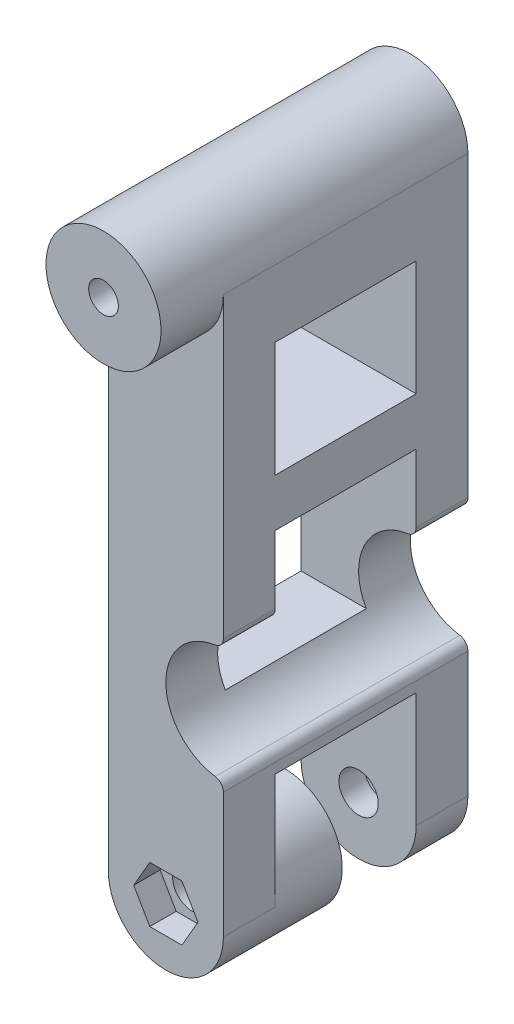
ISO-10303-21;
HEADER;
FILE_DESCRIPTION(('STEP AP214'),'2;1');
FILE_NAME('part.step','',(''),(''),'','','');
FILE_SCHEMA(('AUTOMOTIVE_DESIGN { 1 0 10303 214 1 1 1 1 }'));
ENDSEC;
DATA;
#1=APPLICATION_CONTEXT('core data for automotive mechanical design processes');
#2=APPLICATION_PROTOCOL_DEFINITION('international standard','automotive_design',2000,#1);
#3=PRODUCT_CONTEXT('',#1,'mechanical');
#4=PRODUCT('Part','Part','',(#3));
#5=PRODUCT_RELATED_PRODUCT_CATEGORY('part','',(#4));
#6=PRODUCT_DEFINITION_FORMATION('','',#4);
#7=PRODUCT_DEFINITION_CONTEXT('part definition',#1,'design');
#8=PRODUCT_DEFINITION('design','',#6,#7);
#9=PRODUCT_DEFINITION_SHAPE('','',#8);
#10=(LENGTH_UNIT() NAMED_UNIT(*) SI_UNIT(.MILLI.,.METRE.));
#11=(NAMED_UNIT(*) PLANE_ANGLE_UNIT() SI_UNIT($,.RADIAN.));
#12=(NAMED_UNIT(*) SI_UNIT($,.STERADIAN.) SOLID_ANGLE_UNIT());
#13=UNCERTAINTY_MEASURE_WITH_UNIT(LENGTH_MEASURE(1.E-05),#10,'distance_accuracy_value','');
#14=(GEOMETRIC_REPRESENTATION_CONTEXT(3) GLOBAL_UNCERTAINTY_ASSIGNED_CONTEXT((#13)) GLOBAL_UNIT_ASSIGNED_CONTEXT((#10,
#11,#12)) REPRESENTATION_CONTEXT('',''));
#15=CARTESIAN_POINT('',(0.,0.,0.));
#16=DIRECTION('',(0.,0.,1.));
#17=DIRECTION('',(1.,0.,0.));
#18=AXIS2_PLACEMENT_3D('',#15,#16,#17);
#19=CARTESIAN_POINT('',(12.,0.,-12.75));
#20=DIRECTION('',(1.,0.,0.));
#21=DIRECTION('',(0.,1.,0.));
#22=AXIS2_PLACEMENT_3D('',#19,#20,#21);
#23=PLANE('',#22);
#24=DIRECTION('',(0.,1.,0.));
#25=VECTOR('',#24,1.);
#26=CARTESIAN_POINT('',(12.,17.,-7.35));
#27=LINE('',#26,#25);
#28=CARTESIAN_POINT('',(12.,26.9282032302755,-7.35));
#29=VERTEX_POINT('',#28);
#30=CARTESIAN_POINT('',(12.,34.,-7.35));
#31=VERTEX_POINT('',#30);
#32=EDGE_CURVE('E263',#29,#31,#27,.T.);
#33=ORIENTED_EDGE('',*,*,#32,.F.);
#34=DIRECTION('',(0.,0.,-1.));
#35=VECTOR('',#34,1.);
#36=CARTESIAN_POINT('',(12.,26.9282032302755,-12.75));
#37=LINE('',#36,#35);
#38=CARTESIAN_POINT('',(12.,26.9282032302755,-12.75));
#39=VERTEX_POINT('',#38);
#40=EDGE_CURVE('E373',#29,#39,#37,.T.);
#41=ORIENTED_EDGE('',*,*,#40,.T.);
#42=DIRECTION('',(0.,1.,0.));
#43=VECTOR('',#42,1.);
#44=CARTESIAN_POINT('',(12.,0.,-12.75));
#45=LINE('',#44,#43);
#46=CARTESIAN_POINT('',(12.,58.,-12.75));
#47=VERTEX_POINT('',#46);
#48=EDGE_CURVE('E323',#39,#47,#45,.T.);
#49=ORIENTED_EDGE('',*,*,#48,.T.);
#50=DIRECTION('',(0.,0.,1.));
#51=VECTOR('',#50,1.);
#52=CARTESIAN_POINT('',(12.,58.,-12.75));
#53=LINE('',#52,#51);
#54=CARTESIAN_POINT('',(12.,58.,12.75));
#55=VERTEX_POINT('',#54);
#56=EDGE_CURVE('E345',#47,#55,#53,.T.);
#57=ORIENTED_EDGE('',*,*,#56,.T.);
#58=DIRECTION('',(0.,1.,0.));
#59=VECTOR('',#58,1.);
#60=CARTESIAN_POINT('',(12.,0.,12.75));
#61=LINE('',#60,#59);
#62=CARTESIAN_POINT('',(12.,26.9282032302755,12.75));
#63=VERTEX_POINT('',#62);
#64=EDGE_CURVE('E332',#63,#55,#61,.T.);
#65=ORIENTED_EDGE('',*,*,#64,.F.);
#66=DIRECTION('',(0.,0.,-1.));
#67=VECTOR('',#66,1.);
#68=CARTESIAN_POINT('',(12.,26.9282032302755,7.35));
#69=LINE('',#68,#67);
#70=CARTESIAN_POINT('',(12.,26.9282032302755,7.35));
#71=VERTEX_POINT('',#70);
#72=EDGE_CURVE('E371',#63,#71,#69,.T.);
#73=ORIENTED_EDGE('',*,*,#72,.T.);
#74=DIRECTION('',(0.,-1.,0.));
#75=VECTOR('',#74,1.);
#76=CARTESIAN_POINT('',(12.,17.,7.35));
#77=LINE('',#76,#75);
#78=CARTESIAN_POINT('',(12.,34.,7.35));
#79=VERTEX_POINT('',#78);
#80=EDGE_CURVE('E282',#79,#71,#77,.T.);
#81=ORIENTED_EDGE('',*,*,#80,.F.);
#82=DIRECTION('',(0.,0.,1.));
#83=VECTOR('',#82,1.);
#84=CARTESIAN_POINT('',(12.,34.,7.35));
#85=LINE('',#84,#83);
#86=EDGE_CURVE('E258',#31,#79,#85,.T.);
#87=ORIENTED_EDGE('',*,*,#86,.F.);
#88=EDGE_LOOP('',(#33,#41,#49,#57,#65,#73,#81,#87));
#89=FACE_BOUND('',#88,.T.);
#90=DIRECTION('',(0.,-1.,0.));
#91=VECTOR('',#90,1.);
#92=CARTESIAN_POINT('',(12.,39.,7.35));
#93=LINE('',#92,#91);
#94=CARTESIAN_POINT('',(12.,51.,7.35));
#95=VERTEX_POINT('',#94);
#96=CARTESIAN_POINT('',(12.,39.,7.35));
#97=VERTEX_POINT('',#96);
#98=EDGE_CURVE('E267',#95,#97,#93,.T.);
#99=ORIENTED_EDGE('',*,*,#98,.F.);
#100=DIRECTION('',(0.,0.,1.));
#101=VECTOR('',#100,1.);
#102=CARTESIAN_POINT('',(12.,51.,7.35));
#103=LINE('',#102,#101);
#104=CARTESIAN_POINT('',(12.,51.,-7.35));
#105=VERTEX_POINT('',#104);
#106=EDGE_CURVE('E276',#105,#95,#103,.T.);
#107=ORIENTED_EDGE('',*,*,#106,.F.);
#108=DIRECTION('',(0.,1.,0.));
#109=VECTOR('',#108,1.);
#110=CARTESIAN_POINT('',(12.,39.,-7.35));
#111=LINE('',#110,#109);
#112=CARTESIAN_POINT('',(12.,39.,-7.35));
#113=VERTEX_POINT('',#112);
#114=EDGE_CURVE('E273',#113,#105,#111,.T.);
#115=ORIENTED_EDGE('',*,*,#114,.F.);
#116=DIRECTION('',(0.,0.,-1.));
#117=VECTOR('',#116,1.);
#118=CARTESIAN_POINT('',(12.,39.,7.35));
#119=LINE('',#118,#117);
#120=EDGE_CURVE('E269',#97,#113,#119,.T.);
#121=ORIENTED_EDGE('',*,*,#120,.F.);
#122=EDGE_LOOP('',(#99,#107,#115,#121));
#123=FACE_BOUND('',#122,.T.);
#124=ADVANCED_FACE('F43',(#89,#123),#23,.T.);
#125=CARTESIAN_POINT('',(6.,0.,-12.75));
#126=DIRECTION('',(0.,0.,1.));
#127=DIRECTION('',(1.,0.,0.));
#128=AXIS2_PLACEMENT_3D('',#125,#126,#127);
#129=CYLINDRICAL_SURFACE('',#128,2.05);
#130=CARTESIAN_POINT('',(6.,0.,0.349999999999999));
#131=DIRECTION('',(0.,0.,-1.));
#132=DIRECTION('',(-1.,0.,0.));
#133=AXIS2_PLACEMENT_3D('',#130,#131,#132);
#134=CIRCLE('',#133,2.05);
#135=CARTESIAN_POINT('',(3.95,0.,0.349999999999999));
#136=VERTEX_POINT('',#135);
#137=EDGE_CURVE('E858',#136,#136,#134,.F.);
#138=ORIENTED_EDGE('',*,*,#137,.F.);
#139=EDGE_LOOP('',(#138));
#140=FACE_BOUND('',#139,.T.);
#141=CARTESIAN_POINT('',(6.,0.,10.));
#142=DIRECTION('',(0.,0.,1.));
#143=DIRECTION('',(1.,0.,0.));
#144=AXIS2_PLACEMENT_3D('',#141,#142,#143);
#145=CIRCLE('',#144,2.05);
#146=CARTESIAN_POINT('',(8.05,0.,10.));
#147=VERTEX_POINT('',#146);
#148=EDGE_CURVE('E359',#147,#147,#145,.F.);
#149=ORIENTED_EDGE('',*,*,#148,.F.);
#150=EDGE_LOOP('',(#149));
#151=FACE_BOUND('',#150,.T.);
#152=ADVANCED_FACE('F479',(#140,#151),#129,.F.);
#153=CARTESIAN_POINT('',(6.,0.,-7.35));
#154=DIRECTION('',(0.,0.,-1.));
#155=DIRECTION('',(-1.,0.,0.));
#156=AXIS2_PLACEMENT_3D('',#153,#154,#155);
#157=CIRCLE('',#156,2.05);
#158=CARTESIAN_POINT('',(3.95,0.,-7.35));
#159=VERTEX_POINT('',#158);
#160=EDGE_CURVE('E293',#159,#159,#157,.F.);
#161=ORIENTED_EDGE('',*,*,#160,.T.);
#162=EDGE_LOOP('',(#161));
#163=FACE_BOUND('',#162,.T.);
#164=CARTESIAN_POINT('',(6.,0.,-10.));
#165=DIRECTION('',(0.,0.,-1.));
#166=DIRECTION('',(-1.,0.,0.));
#167=AXIS2_PLACEMENT_3D('',#164,#165,#166);
#168=CIRCLE('',#167,2.05);
#169=CARTESIAN_POINT('',(3.95,0.,-10.));
#170=VERTEX_POINT('',#169);
#171=EDGE_CURVE('E354',#170,#170,#168,.F.);
#172=ORIENTED_EDGE('',*,*,#171,.F.);
#173=EDGE_LOOP('',(#172));
#174=FACE_BOUND('',#173,.T.);
#175=ADVANCED_FACE('F476',(#163,#174),#129,.F.);
#176=CARTESIAN_POINT('',(5.99999999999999,58.,-12.75));
#177=DIRECTION('',(0.,0.,1.));
#178=DIRECTION('',(1.,0.,0.));
#179=AXIS2_PLACEMENT_3D('',#176,#177,#178);
#180=CYLINDRICAL_SURFACE('',#179,6.);
#181=DIRECTION('',(0.,0.,1.));
#182=VECTOR('',#181,1.);
#183=CARTESIAN_POINT('',(0.,58.,-12.75));
#184=LINE('',#183,#182);
#185=CARTESIAN_POINT('',(0.,58.,-12.75));
#186=VERTEX_POINT('',#185);
#187=CARTESIAN_POINT('',(0.,58.,12.75));
#188=VERTEX_POINT('',#187);
#189=EDGE_CURVE('E342',#186,#188,#184,.T.);
#190=ORIENTED_EDGE('',*,*,#189,.T.);
#191=CARTESIAN_POINT('',(5.99999999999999,58.,12.75));
#192=DIRECTION('',(0.,0.,1.));
#193=DIRECTION('',(1.,0.,0.));
#194=AXIS2_PLACEMENT_3D('',#191,#192,#193);
#195=CIRCLE('',#194,6.);
#196=EDGE_CURVE('E252',#188,#55,#195,.T.);
#197=ORIENTED_EDGE('',*,*,#196,.T.);
#198=ORIENTED_EDGE('',*,*,#56,.F.);
#199=CARTESIAN_POINT('',(5.99999999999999,58.,-12.75));
#200=DIRECTION('',(0.,0.,-1.));
#201=DIRECTION('',(-1.,0.,0.));
#202=AXIS2_PLACEMENT_3D('',#199,#200,#201);
#203=CIRCLE('',#202,6.);
#204=EDGE_CURVE('E270',#47,#186,#203,.F.);
#205=ORIENTED_EDGE('',*,*,#204,.T.);
#206=EDGE_LOOP('',(#190,#197,#198,#205));
#207=FACE_BOUND('',#206,.T.);
#208=CARTESIAN_POINT('',(5.99999999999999,58.,19.25));
#209=DIRECTION('',(0.,0.,1.));
#210=DIRECTION('',(1.,0.,0.));
#211=AXIS2_PLACEMENT_3D('',#208,#209,#210);
#212=CIRCLE('',#211,6.);
#213=CARTESIAN_POINT('',(12.,58.,19.25));
#214=VERTEX_POINT('',#213);
#215=EDGE_CURVE('E412',#214,#214,#212,.T.);
#216=ORIENTED_EDGE('',*,*,#215,.F.);
#217=EDGE_LOOP('',(#216));
#218=FACE_BOUND('',#217,.T.);
#219=ADVANCED_FACE('F452',(#207,#218),#180,.T.);
#220=CARTESIAN_POINT('',(6.,0.,-12.75));
#221=DIRECTION('',(0.,0.,1.));
#222=DIRECTION('',(1.,0.,0.));
#223=AXIS2_PLACEMENT_3D('',#220,#221,#222);
#224=CYLINDRICAL_SURFACE('',#223,6.);
#225=DIRECTION('',(0.,0.,1.));
#226=VECTOR('',#225,1.);
#227=CARTESIAN_POINT('',(0.,0.,-12.75));
#228=LINE('',#227,#226);
#229=CARTESIAN_POINT('',(0.,0.,7.35));
#230=VERTEX_POINT('',#229);
#231=CARTESIAN_POINT('',(0.,0.,12.75));
#232=VERTEX_POINT('',#231);
#233=EDGE_CURVE('E341',#230,#232,#228,.T.);
#234=ORIENTED_EDGE('',*,*,#233,.F.);
#235=CARTESIAN_POINT('',(6.,0.,7.35));
#236=DIRECTION('',(0.,0.,-1.));
#237=DIRECTION('',(-1.,0.,0.));
#238=AXIS2_PLACEMENT_3D('',#235,#236,#237);
#239=CIRCLE('',#238,6.);
#240=CARTESIAN_POINT('',(12.,0.,7.35));
#241=VERTEX_POINT('',#240);
#242=EDGE_CURVE('E357',#230,#241,#239,.T.);
#243=ORIENTED_EDGE('',*,*,#242,.T.);
#244=DIRECTION('',(0.,0.,1.));
#245=VECTOR('',#244,1.);
#246=CARTESIAN_POINT('',(12.,0.,-12.75));
#247=LINE('',#246,#245);
#248=CARTESIAN_POINT('',(12.,0.,12.75));
#249=VERTEX_POINT('',#248);
#250=EDGE_CURVE('E329',#241,#249,#247,.T.);
#251=ORIENTED_EDGE('',*,*,#250,.T.);
#252=CARTESIAN_POINT('',(6.,0.,12.75));
#253=DIRECTION('',(0.,0.,1.));
#254=DIRECTION('',(-1.,0.,0.));
#255=AXIS2_PLACEMENT_3D('',#252,#253,#254);
#256=CIRCLE('',#255,6.);
#257=EDGE_CURVE('E319',#232,#249,#256,.T.);
#258=ORIENTED_EDGE('',*,*,#257,.F.);
#259=EDGE_LOOP('',(#234,#243,#251,#258));
#260=FACE_BOUND('',#259,.T.);
#261=CARTESIAN_POINT('',(6.,0.,0.349999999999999));
#262=DIRECTION('',(0.,0.,-1.));
#263=DIRECTION('',(-1.,0.,0.));
#264=AXIS2_PLACEMENT_3D('',#261,#262,#263);
#265=CIRCLE('',#264,6.);
#266=CARTESIAN_POINT('',(0.,0.,0.349999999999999));
#267=VERTEX_POINT('',#266);
#268=EDGE_CURVE('E861',#267,#267,#265,.T.);
#269=ORIENTED_EDGE('',*,*,#268,.F.);
#270=EDGE_LOOP('',(#269));
#271=FACE_BOUND('',#270,.T.);
#272=ADVANCED_FACE('F459',(#260,#271),#224,.T.);
#273=CARTESIAN_POINT('',(6.,0.,-7.35));
#274=DIRECTION('',(0.,0.,-1.));
#275=DIRECTION('',(-1.,0.,0.));
#276=AXIS2_PLACEMENT_3D('',#273,#274,#275);
#277=CIRCLE('',#276,6.);
#278=CARTESIAN_POINT('',(0.,0.,-7.35));
#279=VERTEX_POINT('',#278);
#280=CARTESIAN_POINT('',(12.,0.,-7.35));
#281=VERTEX_POINT('',#280);
#282=EDGE_CURVE('E292',#279,#281,#277,.F.);
#283=ORIENTED_EDGE('',*,*,#282,.F.);
#284=CARTESIAN_POINT('',(0.,0.,-12.75));
#285=VERTEX_POINT('',#284);
#286=EDGE_CURVE('E338',#285,#279,#228,.T.);
#287=ORIENTED_EDGE('',*,*,#286,.F.);
#288=CARTESIAN_POINT('',(6.,0.,-12.75));
#289=DIRECTION('',(0.,0.,1.));
#290=DIRECTION('',(-1.,0.,0.));
#291=AXIS2_PLACEMENT_3D('',#288,#289,#290);
#292=CIRCLE('',#291,6.);
#293=CARTESIAN_POINT('',(12.,0.,-12.75));
#294=VERTEX_POINT('',#293);
#295=EDGE_CURVE('E320',#285,#294,#292,.T.);
#296=ORIENTED_EDGE('',*,*,#295,.T.);
#297=EDGE_CURVE('E348',#294,#281,#247,.T.);
#298=ORIENTED_EDGE('',*,*,#297,.T.);
#299=EDGE_LOOP('',(#283,#287,#296,#298));
#300=FACE_BOUND('',#299,.T.);
#301=ADVANCED_FACE('F400',(#300),#224,.T.);
#302=CARTESIAN_POINT('',(0.,0.,-12.75));
#303=DIRECTION('',(-1.,0.,0.));
#304=DIRECTION('',(0.,-1.,0.));
#305=AXIS2_PLACEMENT_3D('',#302,#303,#304);
#306=PLANE('',#305);
#307=DIRECTION('',(0.,-1.,0.));
#308=VECTOR('',#307,1.);
#309=CARTESIAN_POINT('',(0.,0.,-12.75));
#310=LINE('',#309,#308);
#311=EDGE_CURVE('E327',#186,#285,#310,.T.);
#312=ORIENTED_EDGE('',*,*,#311,.T.);
#313=ORIENTED_EDGE('',*,*,#286,.T.);
#314=DIRECTION('',(0.,-1.,0.));
#315=VECTOR('',#314,1.);
#316=CARTESIAN_POINT('',(0.,0.,-7.35));
#317=LINE('',#316,#315);
#318=CARTESIAN_POINT('',(0.,12.,-7.35));
#319=VERTEX_POINT('',#318);
#320=EDGE_CURVE('E289',#319,#279,#317,.T.);
#321=ORIENTED_EDGE('',*,*,#320,.F.);
#322=DIRECTION('',(0.,0.,-1.));
#323=VECTOR('',#322,1.);
#324=CARTESIAN_POINT('',(0.,12.,-12.75));
#325=LINE('',#324,#323);
#326=CARTESIAN_POINT('',(0.,12.,7.35));
#327=VERTEX_POINT('',#326);
#328=EDGE_CURVE('E314',#327,#319,#325,.T.);
#329=ORIENTED_EDGE('',*,*,#328,.F.);
#330=DIRECTION('',(0.,1.,0.));
#331=VECTOR('',#330,1.);
#332=CARTESIAN_POINT('',(0.,0.,7.35));
#333=LINE('',#332,#331);
#334=EDGE_CURVE('E295',#230,#327,#333,.T.);
#335=ORIENTED_EDGE('',*,*,#334,.F.);
#336=ORIENTED_EDGE('',*,*,#233,.T.);
#337=DIRECTION('',(0.,-1.,0.));
#338=VECTOR('',#337,1.);
#339=CARTESIAN_POINT('',(0.,0.,12.75));
#340=LINE('',#339,#338);
#341=EDGE_CURVE('E324',#188,#232,#340,.T.);
#342=ORIENTED_EDGE('',*,*,#341,.F.);
#343=ORIENTED_EDGE('',*,*,#189,.F.);
#344=EDGE_LOOP('',(#312,#313,#321,#329,#335,#336,#342,#343));
#345=FACE_BOUND('',#344,.T.);
#346=DIRECTION('',(0.,1.,0.));
#347=VECTOR('',#346,1.);
#348=CARTESIAN_POINT('',(0.,0.,7.35));
#349=LINE('',#348,#347);
#350=CARTESIAN_POINT('',(0.,17.,7.35));
#351=VERTEX_POINT('',#350);
#352=CARTESIAN_POINT('',(0.,34.,7.35));
#353=VERTEX_POINT('',#352);
#354=EDGE_CURVE('E312',#351,#353,#349,.T.);
#355=ORIENTED_EDGE('',*,*,#354,.F.);
#356=DIRECTION('',(0.,0.,1.));
#357=VECTOR('',#356,1.);
#358=CARTESIAN_POINT('',(0.,17.,-12.75));
#359=LINE('',#358,#357);
#360=CARTESIAN_POINT('',(0.,17.,-7.35));
#361=VERTEX_POINT('',#360);
#362=EDGE_CURVE('E256',#361,#351,#359,.T.);
#363=ORIENTED_EDGE('',*,*,#362,.F.);
#364=DIRECTION('',(0.,-1.,0.));
#365=VECTOR('',#364,1.);
#366=CARTESIAN_POINT('',(0.,0.,-7.35));
#367=LINE('',#366,#365);
#368=CARTESIAN_POINT('',(0.,34.,-7.35));
#369=VERTEX_POINT('',#368);
#370=EDGE_CURVE('E307',#369,#361,#367,.T.);
#371=ORIENTED_EDGE('',*,*,#370,.F.);
#372=DIRECTION('',(0.,0.,-1.));
#373=VECTOR('',#372,1.);
#374=CARTESIAN_POINT('',(0.,34.,-12.75));
#375=LINE('',#374,#373);
#376=EDGE_CURVE('E310',#353,#369,#375,.T.);
#377=ORIENTED_EDGE('',*,*,#376,.F.);
#378=EDGE_LOOP('',(#355,#363,#371,#377));
#379=FACE_BOUND('',#378,.T.);
#380=DIRECTION('',(0.,1.,0.));
#381=VECTOR('',#380,1.);
#382=CARTESIAN_POINT('',(0.,0.,7.35));
#383=LINE('',#382,#381);
#384=CARTESIAN_POINT('',(0.,39.,7.35));
#385=VERTEX_POINT('',#384);
#386=CARTESIAN_POINT('',(0.,51.,7.35));
#387=VERTEX_POINT('',#386);
#388=EDGE_CURVE('E304',#385,#387,#383,.T.);
#389=ORIENTED_EDGE('',*,*,#388,.F.);
#390=DIRECTION('',(0.,0.,1.));
#391=VECTOR('',#390,1.);
#392=CARTESIAN_POINT('',(0.,39.,-12.75));
#393=LINE('',#392,#391);
#394=CARTESIAN_POINT('',(0.,39.,-7.35));
#395=VERTEX_POINT('',#394);
#396=EDGE_CURVE('E297',#395,#385,#393,.T.);
#397=ORIENTED_EDGE('',*,*,#396,.F.);
#398=DIRECTION('',(0.,-1.,0.));
#399=VECTOR('',#398,1.);
#400=CARTESIAN_POINT('',(0.,0.,-7.35));
#401=LINE('',#400,#399);
#402=CARTESIAN_POINT('',(0.,51.,-7.35));
#403=VERTEX_POINT('',#402);
#404=EDGE_CURVE('E299',#403,#395,#401,.T.);
#405=ORIENTED_EDGE('',*,*,#404,.F.);
#406=DIRECTION('',(0.,0.,-1.));
#407=VECTOR('',#406,1.);
#408=CARTESIAN_POINT('',(0.,51.,-12.75));
#409=LINE('',#408,#407);
#410=EDGE_CURVE('E302',#387,#403,#409,.T.);
#411=ORIENTED_EDGE('',*,*,#410,.F.);
#412=EDGE_LOOP('',(#389,#397,#405,#411));
#413=FACE_BOUND('',#412,.T.);
#414=ADVANCED_FACE('F403',(#345,#379,#413),#306,.T.);
#415=CARTESIAN_POINT('',(12.,13.0717967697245,-12.75));
#416=VERTEX_POINT('',#415);
#417=EDGE_CURVE('E325',#294,#416,#45,.T.);
#418=ORIENTED_EDGE('',*,*,#417,.T.);
#419=DIRECTION('',(0.,0.,-1.));
#420=VECTOR('',#419,1.);
#421=CARTESIAN_POINT('',(12.,13.0717967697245,12.75));
#422=LINE('',#421,#420);
#423=CARTESIAN_POINT('',(12.,13.0717967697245,12.75));
#424=VERTEX_POINT('',#423);
#425=EDGE_CURVE('E378',#416,#424,#422,.F.);
#426=ORIENTED_EDGE('',*,*,#425,.T.);
#427=EDGE_CURVE('E333',#249,#424,#61,.T.);
#428=ORIENTED_EDGE('',*,*,#427,.F.);
#429=ORIENTED_EDGE('',*,*,#250,.F.);
#430=DIRECTION('',(0.,-1.,0.));
#431=VECTOR('',#430,1.);
#432=CARTESIAN_POINT('',(12.,-6.,7.35));
#433=LINE('',#432,#431);
#434=CARTESIAN_POINT('',(12.,12.,7.35));
#435=VERTEX_POINT('',#434);
#436=EDGE_CURVE('E419',#435,#241,#433,.T.);
#437=ORIENTED_EDGE('',*,*,#436,.F.);
#438=DIRECTION('',(0.,0.,1.));
#439=VECTOR('',#438,1.);
#440=CARTESIAN_POINT('',(12.,12.,7.35));
#441=LINE('',#440,#439);
#442=CARTESIAN_POINT('',(12.,12.,-7.35));
#443=VERTEX_POINT('',#442);
#444=EDGE_CURVE('E426',#443,#435,#441,.T.);
#445=ORIENTED_EDGE('',*,*,#444,.F.);
#446=DIRECTION('',(0.,1.,0.));
#447=VECTOR('',#446,1.);
#448=CARTESIAN_POINT('',(12.,-6.,-7.35));
#449=LINE('',#448,#447);
#450=EDGE_CURVE('E422',#281,#443,#449,.T.);
#451=ORIENTED_EDGE('',*,*,#450,.F.);
#452=ORIENTED_EDGE('',*,*,#297,.F.);
#453=EDGE_LOOP('',(#418,#426,#428,#429,#437,#445,#451,#452));
#454=FACE_BOUND('',#453,.T.);
#455=ADVANCED_FACE('F391',(#454),#23,.T.);
#456=CARTESIAN_POINT('',(6.,0.,-12.75));
#457=DIRECTION('',(0.,0.,-1.));
#458=DIRECTION('',(-1.,0.,0.));
#459=AXIS2_PLACEMENT_3D('',#456,#457,#458);
#460=PLANE('',#459);
#461=ORIENTED_EDGE('',*,*,#48,.F.);
#462=CARTESIAN_POINT('',(11.,26.9282032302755,-12.75));
#463=DIRECTION('',(0.,0.,-1.));
#464=DIRECTION('',(-1.,0.,0.));
#465=AXIS2_PLACEMENT_3D('',#462,#463,#464);
#466=CIRCLE('',#465,1.);
#467=CARTESIAN_POINT('',(11.1428571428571,25.9384599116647,-12.75));
#468=VERTEX_POINT('',#467);
#469=EDGE_CURVE('E376',#39,#468,#466,.T.);
#470=ORIENTED_EDGE('',*,*,#469,.T.);
#471=CARTESIAN_POINT('',(12.,20.,-12.75));
#472=DIRECTION('',(0.,0.,1.));
#473=DIRECTION('',(1.,0.,0.));
#474=AXIS2_PLACEMENT_3D('',#471,#472,#473);
#475=CIRCLE('',#474,6.);
#476=CARTESIAN_POINT('',(11.1428571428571,14.0615400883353,-12.75));
#477=VERTEX_POINT('',#476);
#478=EDGE_CURVE('E387',#468,#477,#475,.T.);
#479=ORIENTED_EDGE('',*,*,#478,.T.);
#480=CARTESIAN_POINT('',(11.,13.0717967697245,-12.75));
#481=DIRECTION('',(0.,0.,-1.));
#482=DIRECTION('',(-1.,0.,0.));
#483=AXIS2_PLACEMENT_3D('',#480,#481,#482);
#484=CIRCLE('',#483,1.);
#485=EDGE_CURVE('E65',#477,#416,#484,.T.);
#486=ORIENTED_EDGE('',*,*,#485,.T.);
#487=ORIENTED_EDGE('',*,*,#417,.F.);
#488=ORIENTED_EDGE('',*,*,#295,.F.);
#489=ORIENTED_EDGE('',*,*,#311,.F.);
#490=ORIENTED_EDGE('',*,*,#204,.F.);
#491=EDGE_LOOP('',(#461,#470,#479,#486,#487,#488,#489,#490));
#492=FACE_BOUND('',#491,.T.);
#493=CARTESIAN_POINT('',(6.,0.,-12.75));
#494=DIRECTION('',(0.,0.,-1.));
#495=DIRECTION('',(-1.,0.,0.));
#496=AXIS2_PLACEMENT_3D('',#493,#494,#495);
#497=CIRCLE('',#496,3.15);
#498=CARTESIAN_POINT('',(2.85,0.,-12.75));
#499=VERTEX_POINT('',#498);
#500=EDGE_CURVE('E361',#499,#499,#497,.T.);
#501=ORIENTED_EDGE('',*,*,#500,.F.);
#502=EDGE_LOOP('',(#501));
#503=FACE_BOUND('',#502,.T.);
#504=CARTESIAN_POINT('',(5.99999999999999,58.,-12.75));
#505=DIRECTION('',(0.,0.,1.));
#506=DIRECTION('',(1.,0.,0.));
#507=AXIS2_PLACEMENT_3D('',#504,#505,#506);
#508=CIRCLE('',#507,1.55);
#509=CARTESIAN_POINT('',(7.54999999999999,58.,-12.75));
#510=VERTEX_POINT('',#509);
#511=EDGE_CURVE('E316',#510,#510,#508,.T.);
#512=ORIENTED_EDGE('',*,*,#511,.T.);
#513=EDGE_LOOP('',(#512));
#514=FACE_BOUND('',#513,.T.);
#515=ADVANCED_FACE('F395',(#492,#503,#514),#460,.T.);
#516=CARTESIAN_POINT('',(6.,0.,12.75));
#517=DIRECTION('',(0.,0.,-1.));
#518=DIRECTION('',(-1.,0.,0.));
#519=AXIS2_PLACEMENT_3D('',#516,#517,#518);
#520=PLANE('',#519);
#521=DIRECTION('',(-0.5,-0.866025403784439,0.));
#522=VECTOR('',#521,1.);
#523=CARTESIAN_POINT('',(4.32568421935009,2.9,12.75));
#524=LINE('',#523,#522);
#525=CARTESIAN_POINT('',(4.32568421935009,2.9,12.75));
#526=VERTEX_POINT('',#525);
#527=CARTESIAN_POINT('',(2.65136843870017,0.,12.75));
#528=VERTEX_POINT('',#527);
#529=EDGE_CURVE('E822',#526,#528,#524,.T.);
#530=ORIENTED_EDGE('',*,*,#529,.F.);
#531=DIRECTION('',(-1.,0.,0.));
#532=VECTOR('',#531,1.);
#533=CARTESIAN_POINT('',(7.67431578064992,2.9,12.75));
#534=LINE('',#533,#532);
#535=CARTESIAN_POINT('',(7.67431578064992,2.9,12.75));
#536=VERTEX_POINT('',#535);
#537=EDGE_CURVE('E240',#536,#526,#534,.T.);
#538=ORIENTED_EDGE('',*,*,#537,.F.);
#539=DIRECTION('',(-0.5,0.866025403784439,0.));
#540=VECTOR('',#539,1.);
#541=CARTESIAN_POINT('',(9.34863156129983,0.,12.75));
#542=LINE('',#541,#540);
#543=CARTESIAN_POINT('',(9.34863156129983,0.,12.75));
#544=VERTEX_POINT('',#543);
#545=EDGE_CURVE('E839',#544,#536,#542,.T.);
#546=ORIENTED_EDGE('',*,*,#545,.F.);
#547=DIRECTION('',(0.5,0.866025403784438,0.));
#548=VECTOR('',#547,1.);
#549=CARTESIAN_POINT('',(7.67431578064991,-2.9,12.75));
#550=LINE('',#549,#548);
#551=CARTESIAN_POINT('',(7.67431578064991,-2.9,12.75));
#552=VERTEX_POINT('',#551);
#553=EDGE_CURVE('E836',#552,#544,#550,.T.);
#554=ORIENTED_EDGE('',*,*,#553,.F.);
#555=DIRECTION('',(1.,0.,0.));
#556=VECTOR('',#555,1.);
#557=CARTESIAN_POINT('',(4.32568421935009,-2.9,12.75));
#558=LINE('',#557,#556);
#559=CARTESIAN_POINT('',(4.32568421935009,-2.9,12.75));
#560=VERTEX_POINT('',#559);
#561=EDGE_CURVE('E829',#560,#552,#558,.T.);
#562=ORIENTED_EDGE('',*,*,#561,.F.);
#563=DIRECTION('',(0.5,-0.866025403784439,0.));
#564=VECTOR('',#563,1.);
#565=CARTESIAN_POINT('',(2.65136843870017,0.,12.75));
#566=LINE('',#565,#564);
#567=EDGE_CURVE('E826',#528,#560,#566,.T.);
#568=ORIENTED_EDGE('',*,*,#567,.F.);
#569=EDGE_LOOP('',(#530,#538,#546,#554,#562,#568));
#570=FACE_BOUND('',#569,.T.);
#571=ORIENTED_EDGE('',*,*,#427,.T.);
#572=CARTESIAN_POINT('',(11.,13.0717967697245,12.75));
#573=DIRECTION('',(0.,0.,-1.));
#574=DIRECTION('',(-1.,0.,0.));
#575=AXIS2_PLACEMENT_3D('',#572,#573,#574);
#576=CIRCLE('',#575,1.);
#577=CARTESIAN_POINT('',(11.1428571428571,14.0615400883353,12.75));
#578=VERTEX_POINT('',#577);
#579=EDGE_CURVE('E51',#424,#578,#576,.F.);
#580=ORIENTED_EDGE('',*,*,#579,.T.);
#581=CARTESIAN_POINT('',(12.,20.,12.75));
#582=DIRECTION('',(0.,0.,1.));
#583=DIRECTION('',(1.,0.,0.));
#584=AXIS2_PLACEMENT_3D('',#581,#582,#583);
#585=CIRCLE('',#584,6.);
#586=CARTESIAN_POINT('',(11.1428571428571,25.9384599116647,12.75));
#587=VERTEX_POINT('',#586);
#588=EDGE_CURVE('E385',#587,#578,#585,.T.);
#589=ORIENTED_EDGE('',*,*,#588,.F.);
#590=CARTESIAN_POINT('',(11.,26.9282032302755,12.75));
#591=DIRECTION('',(0.,0.,-1.));
#592=DIRECTION('',(-1.,0.,0.));
#593=AXIS2_PLACEMENT_3D('',#590,#591,#592);
#594=CIRCLE('',#593,1.);
#595=EDGE_CURVE('E380',#587,#63,#594,.F.);
#596=ORIENTED_EDGE('',*,*,#595,.T.);
#597=ORIENTED_EDGE('',*,*,#64,.T.);
#598=ORIENTED_EDGE('',*,*,#196,.F.);
#599=ORIENTED_EDGE('',*,*,#341,.T.);
#600=ORIENTED_EDGE('',*,*,#257,.T.);
#601=EDGE_LOOP('',(#571,#580,#589,#596,#597,#598,#599,#600));
#602=FACE_BOUND('',#601,.T.);
#603=ADVANCED_FACE('F384',(#570,#602),#520,.F.);
#604=CARTESIAN_POINT('',(5.99999999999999,58.,-12.75));
#605=DIRECTION('',(0.,0.,1.));
#606=DIRECTION('',(1.,0.,0.));
#607=AXIS2_PLACEMENT_3D('',#604,#605,#606);
#608=CYLINDRICAL_SURFACE('',#607,1.55);
#609=ORIENTED_EDGE('',*,*,#511,.F.);
#610=EDGE_LOOP('',(#609));
#611=FACE_BOUND('',#610,.T.);
#612=CARTESIAN_POINT('',(5.99999999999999,58.,19.25));
#613=DIRECTION('',(0.,0.,1.));
#614=DIRECTION('',(1.,0.,0.));
#615=AXIS2_PLACEMENT_3D('',#612,#613,#614);
#616=CIRCLE('',#615,1.55);
#617=CARTESIAN_POINT('',(7.54999999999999,58.,19.25));
#618=VERTEX_POINT('',#617);
#619=EDGE_CURVE('E415',#618,#618,#616,.F.);
#620=ORIENTED_EDGE('',*,*,#619,.F.);
#621=EDGE_LOOP('',(#620));
#622=FACE_BOUND('',#621,.T.);
#623=ADVANCED_FACE('F762',(#611,#622),#608,.F.);
#624=CARTESIAN_POINT('',(-8.,-6.,7.35));
#625=DIRECTION('',(0.,0.,1.));
#626=DIRECTION('',(1.,0.,0.));
#627=AXIS2_PLACEMENT_3D('',#624,#625,#626);
#628=PLANE('',#627);
#629=ORIENTED_EDGE('',*,*,#242,.F.);
#630=ORIENTED_EDGE('',*,*,#334,.T.);
#631=DIRECTION('',(1.,0.,0.));
#632=VECTOR('',#631,1.);
#633=CARTESIAN_POINT('',(-8.,12.,7.35));
#634=LINE('',#633,#632);
#635=EDGE_CURVE('E353',#327,#435,#634,.T.);
#636=ORIENTED_EDGE('',*,*,#635,.T.);
#637=ORIENTED_EDGE('',*,*,#436,.T.);
#638=EDGE_LOOP('',(#629,#630,#636,#637));
#639=FACE_BOUND('',#638,.T.);
#640=ADVANCED_FACE('F464',(#639),#628,.F.);
#641=CARTESIAN_POINT('',(-8.,-6.,-7.35));
#642=DIRECTION('',(0.,0.,-1.));
#643=DIRECTION('',(-1.,0.,0.));
#644=AXIS2_PLACEMENT_3D('',#641,#642,#643);
#645=PLANE('',#644);
#646=ORIENTED_EDGE('',*,*,#282,.T.);
#647=ORIENTED_EDGE('',*,*,#450,.T.);
#648=DIRECTION('',(1.,0.,0.));
#649=VECTOR('',#648,1.);
#650=CARTESIAN_POINT('',(-8.,12.,-7.35));
#651=LINE('',#650,#649);
#652=EDGE_CURVE('E429',#319,#443,#651,.T.);
#653=ORIENTED_EDGE('',*,*,#652,.F.);
#654=ORIENTED_EDGE('',*,*,#320,.T.);
#655=EDGE_LOOP('',(#646,#647,#653,#654));
#656=FACE_BOUND('',#655,.T.);
#657=ORIENTED_EDGE('',*,*,#160,.F.);
#658=EDGE_LOOP('',(#657));
#659=FACE_BOUND('',#658,.T.);
#660=ADVANCED_FACE('F470',(#656,#659),#645,.F.);
#661=CARTESIAN_POINT('',(-8.,12.,7.35));
#662=DIRECTION('',(0.,1.,0.));
#663=DIRECTION('',(-1.,0.,0.));
#664=AXIS2_PLACEMENT_3D('',#661,#662,#663);
#665=PLANE('',#664);
#666=ORIENTED_EDGE('',*,*,#328,.T.);
#667=ORIENTED_EDGE('',*,*,#652,.T.);
#668=ORIENTED_EDGE('',*,*,#444,.T.);
#669=ORIENTED_EDGE('',*,*,#635,.F.);
#670=EDGE_LOOP('',(#666,#667,#668,#669));
#671=FACE_BOUND('',#670,.T.);
#672=ADVANCED_FACE('F467',(#671),#665,.F.);
#673=CARTESIAN_POINT('',(-8.00000000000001,39.,7.35));
#674=DIRECTION('',(0.,0.,1.));
#675=DIRECTION('',(1.,0.,0.));
#676=AXIS2_PLACEMENT_3D('',#673,#674,#675);
#677=PLANE('',#676);
#678=ORIENTED_EDGE('',*,*,#388,.T.);
#679=DIRECTION('',(1.,0.,0.));
#680=VECTOR('',#679,1.);
#681=CARTESIAN_POINT('',(-8.00000000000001,51.,7.35));
#682=LINE('',#681,#680);
#683=EDGE_CURVE('E280',#387,#95,#682,.T.);
#684=ORIENTED_EDGE('',*,*,#683,.T.);
#685=ORIENTED_EDGE('',*,*,#98,.T.);
#686=DIRECTION('',(1.,0.,0.));
#687=VECTOR('',#686,1.);
#688=CARTESIAN_POINT('',(-8.00000000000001,39.,7.35));
#689=LINE('',#688,#687);
#690=EDGE_CURVE('E279',#385,#97,#689,.T.);
#691=ORIENTED_EDGE('',*,*,#690,.F.);
#692=EDGE_LOOP('',(#678,#684,#685,#691));
#693=FACE_BOUND('',#692,.T.);
#694=ADVANCED_FACE('F734',(#693),#677,.F.);
#695=CARTESIAN_POINT('',(-8.00000000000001,51.,7.35));
#696=DIRECTION('',(0.,1.,0.));
#697=DIRECTION('',(-1.,0.,0.));
#698=AXIS2_PLACEMENT_3D('',#695,#696,#697);
#699=PLANE('',#698);
#700=ORIENTED_EDGE('',*,*,#410,.T.);
#701=DIRECTION('',(1.,0.,0.));
#702=VECTOR('',#701,1.);
#703=CARTESIAN_POINT('',(-8.00000000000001,51.,-7.35));
#704=LINE('',#703,#702);
#705=EDGE_CURVE('E283',#403,#105,#704,.T.);
#706=ORIENTED_EDGE('',*,*,#705,.T.);
#707=ORIENTED_EDGE('',*,*,#106,.T.);
#708=ORIENTED_EDGE('',*,*,#683,.F.);
#709=EDGE_LOOP('',(#700,#706,#707,#708));
#710=FACE_BOUND('',#709,.T.);
#711=ADVANCED_FACE('F725',(#710),#699,.F.);
#712=CARTESIAN_POINT('',(-8.00000000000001,39.,-7.35));
#713=DIRECTION('',(0.,0.,-1.));
#714=DIRECTION('',(-1.,0.,0.));
#715=AXIS2_PLACEMENT_3D('',#712,#713,#714);
#716=PLANE('',#715);
#717=ORIENTED_EDGE('',*,*,#404,.T.);
#718=DIRECTION('',(1.,0.,0.));
#719=VECTOR('',#718,1.);
#720=CARTESIAN_POINT('',(-8.00000000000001,39.,-7.35));
#721=LINE('',#720,#719);
#722=EDGE_CURVE('E285',#395,#113,#721,.T.);
#723=ORIENTED_EDGE('',*,*,#722,.T.);
#724=ORIENTED_EDGE('',*,*,#114,.T.);
#725=ORIENTED_EDGE('',*,*,#705,.F.);
#726=EDGE_LOOP('',(#717,#723,#724,#725));
#727=FACE_BOUND('',#726,.T.);
#728=ADVANCED_FACE('F716',(#727),#716,.F.);
#729=CARTESIAN_POINT('',(-8.00000000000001,39.,7.35));
#730=DIRECTION('',(0.,-1.,0.));
#731=DIRECTION('',(1.,0.,0.));
#732=AXIS2_PLACEMENT_3D('',#729,#730,#731);
#733=PLANE('',#732);
#734=ORIENTED_EDGE('',*,*,#396,.T.);
#735=ORIENTED_EDGE('',*,*,#690,.T.);
#736=ORIENTED_EDGE('',*,*,#120,.T.);
#737=ORIENTED_EDGE('',*,*,#722,.F.);
#738=EDGE_LOOP('',(#734,#735,#736,#737));
#739=FACE_BOUND('',#738,.T.);
#740=ADVANCED_FACE('F708',(#739),#733,.F.);
#741=CARTESIAN_POINT('',(-8.,17.,7.35));
#742=DIRECTION('',(0.,0.,1.));
#743=DIRECTION('',(1.,0.,0.));
#744=AXIS2_PLACEMENT_3D('',#741,#742,#743);
#745=PLANE('',#744);
#746=ORIENTED_EDGE('',*,*,#80,.T.);
#747=CARTESIAN_POINT('',(11.,26.9282032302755,7.35));
#748=DIRECTION('',(0.,0.,1.));
#749=DIRECTION('',(1.,0.,0.));
#750=AXIS2_PLACEMENT_3D('',#747,#748,#749);
#751=CIRCLE('',#750,1.);
#752=CARTESIAN_POINT('',(11.1428571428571,25.9384599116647,7.35));
#753=VERTEX_POINT('',#752);
#754=EDGE_CURVE('E11',#71,#753,#751,.F.);
#755=ORIENTED_EDGE('',*,*,#754,.T.);
#756=CARTESIAN_POINT('',(12.,20.,7.35));
#757=DIRECTION('',(0.,0.,1.));
#758=DIRECTION('',(1.,0.,0.));
#759=AXIS2_PLACEMENT_3D('',#756,#757,#758);
#760=CIRCLE('',#759,6.);
#761=CARTESIAN_POINT('',(6.80384757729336,17.,7.35));
#762=VERTEX_POINT('',#761);
#763=EDGE_CURVE('E229',#753,#762,#760,.T.);
#764=ORIENTED_EDGE('',*,*,#763,.T.);
#765=DIRECTION('',(1.,0.,0.));
#766=VECTOR('',#765,1.);
#767=CARTESIAN_POINT('',(-8.,17.,7.35));
#768=LINE('',#767,#766);
#769=EDGE_CURVE('E234',#351,#762,#768,.T.);
#770=ORIENTED_EDGE('',*,*,#769,.F.);
#771=ORIENTED_EDGE('',*,*,#354,.T.);
#772=DIRECTION('',(1.,0.,0.));
#773=VECTOR('',#772,1.);
#774=CARTESIAN_POINT('',(-8.00000000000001,34.,7.35));
#775=LINE('',#774,#773);
#776=EDGE_CURVE('E423',#353,#79,#775,.T.);
#777=ORIENTED_EDGE('',*,*,#776,.T.);
#778=EDGE_LOOP('',(#746,#755,#764,#770,#771,#777));
#779=FACE_BOUND('',#778,.T.);
#780=ADVANCED_FACE('F232',(#779),#745,.F.);
#781=CARTESIAN_POINT('',(-8.00000000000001,34.,7.35));
#782=DIRECTION('',(0.,1.,0.));
#783=DIRECTION('',(-1.,0.,0.));
#784=AXIS2_PLACEMENT_3D('',#781,#782,#783);
#785=PLANE('',#784);
#786=ORIENTED_EDGE('',*,*,#376,.T.);
#787=DIRECTION('',(1.,0.,0.));
#788=VECTOR('',#787,1.);
#789=CARTESIAN_POINT('',(-8.00000000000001,34.,-7.35));
#790=LINE('',#789,#788);
#791=EDGE_CURVE('E260',#369,#31,#790,.T.);
#792=ORIENTED_EDGE('',*,*,#791,.T.);
#793=ORIENTED_EDGE('',*,*,#86,.T.);
#794=ORIENTED_EDGE('',*,*,#776,.F.);
#795=EDGE_LOOP('',(#786,#792,#793,#794));
#796=FACE_BOUND('',#795,.T.);
#797=ADVANCED_FACE('F438',(#796),#785,.F.);
#798=CARTESIAN_POINT('',(-8.,17.,-7.35));
#799=DIRECTION('',(0.,0.,-1.));
#800=DIRECTION('',(0.,1.,0.));
#801=AXIS2_PLACEMENT_3D('',#798,#799,#800);
#802=PLANE('',#801);
#803=CARTESIAN_POINT('',(12.,20.,-7.35));
#804=DIRECTION('',(0.,0.,-1.));
#805=DIRECTION('',(0.,1.,0.));
#806=AXIS2_PLACEMENT_3D('',#803,#804,#805);
#807=CIRCLE('',#806,6.);
#808=CARTESIAN_POINT('',(6.80384757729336,17.,-7.35));
#809=VERTEX_POINT('',#808);
#810=CARTESIAN_POINT('',(11.1428571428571,25.9384599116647,-7.35));
#811=VERTEX_POINT('',#810);
#812=EDGE_CURVE('E241',#809,#811,#807,.T.);
#813=ORIENTED_EDGE('',*,*,#812,.T.);
#814=CARTESIAN_POINT('',(11.,26.9282032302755,-7.35));
#815=DIRECTION('',(0.,0.,-1.));
#816=DIRECTION('',(0.,1.,0.));
#817=AXIS2_PLACEMENT_3D('',#814,#815,#816);
#818=CIRCLE('',#817,1.);
#819=EDGE_CURVE('E369',#811,#29,#818,.F.);
#820=ORIENTED_EDGE('',*,*,#819,.T.);
#821=ORIENTED_EDGE('',*,*,#32,.T.);
#822=ORIENTED_EDGE('',*,*,#791,.F.);
#823=ORIENTED_EDGE('',*,*,#370,.T.);
#824=DIRECTION('',(1.,0.,0.));
#825=VECTOR('',#824,1.);
#826=CARTESIAN_POINT('',(-8.,17.,-7.35));
#827=LINE('',#826,#825);
#828=EDGE_CURVE('E257',#361,#809,#827,.T.);
#829=ORIENTED_EDGE('',*,*,#828,.T.);
#830=EDGE_LOOP('',(#813,#820,#821,#822,#823,#829));
#831=FACE_BOUND('',#830,.T.);
#832=ADVANCED_FACE('F688',(#831),#802,.F.);
#833=CARTESIAN_POINT('',(-8.,17.,7.35));
#834=DIRECTION('',(0.,-1.,0.));
#835=DIRECTION('',(1.,0.,0.));
#836=AXIS2_PLACEMENT_3D('',#833,#834,#835);
#837=PLANE('',#836);
#838=ORIENTED_EDGE('',*,*,#769,.T.);
#839=DIRECTION('',(0.,0.,1.));
#840=VECTOR('',#839,1.);
#841=CARTESIAN_POINT('',(6.80384757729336,17.,-12.75));
#842=LINE('',#841,#840);
#843=EDGE_CURVE('E244',#762,#809,#842,.F.);
#844=ORIENTED_EDGE('',*,*,#843,.T.);
#845=ORIENTED_EDGE('',*,*,#828,.F.);
#846=ORIENTED_EDGE('',*,*,#362,.T.);
#847=EDGE_LOOP('',(#838,#844,#845,#846));
#848=FACE_BOUND('',#847,.T.);
#849=ADVANCED_FACE('F254',(#848),#837,.F.);
#850=CARTESIAN_POINT('',(0.,0.,19.25));
#851=DIRECTION('',(0.,0.,1.));
#852=DIRECTION('',(1.,0.,0.));
#853=AXIS2_PLACEMENT_3D('',#850,#851,#852);
#854=PLANE('',#853);
#855=ORIENTED_EDGE('',*,*,#619,.T.);
#856=EDGE_LOOP('',(#855));
#857=FACE_BOUND('',#856,.T.);
#858=ORIENTED_EDGE('',*,*,#215,.T.);
#859=EDGE_LOOP('',(#858));
#860=FACE_BOUND('',#859,.T.);
#861=ADVANCED_FACE('F496',(#857,#860),#854,.T.);
#862=CARTESIAN_POINT('',(0.,0.,0.349999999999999));
#863=DIRECTION('',(0.,0.,-1.));
#864=DIRECTION('',(-1.,0.,0.));
#865=AXIS2_PLACEMENT_3D('',#862,#863,#864);
#866=PLANE('',#865);
#867=ORIENTED_EDGE('',*,*,#137,.T.);
#868=EDGE_LOOP('',(#867));
#869=FACE_BOUND('',#868,.T.);
#870=ORIENTED_EDGE('',*,*,#268,.T.);
#871=EDGE_LOOP('',(#870));
#872=FACE_BOUND('',#871,.T.);
#873=ADVANCED_FACE('F486',(#869,#872),#866,.T.);
#874=CARTESIAN_POINT('',(6.,0.,-10.));
#875=DIRECTION('',(0.,0.,-1.));
#876=DIRECTION('',(-1.,0.,0.));
#877=AXIS2_PLACEMENT_3D('',#874,#875,#876);
#878=PLANE('',#877);
#879=CARTESIAN_POINT('',(6.,0.,-10.));
#880=DIRECTION('',(0.,0.,-1.));
#881=DIRECTION('',(-1.,0.,0.));
#882=AXIS2_PLACEMENT_3D('',#879,#880,#881);
#883=CIRCLE('',#882,3.15);
#884=CARTESIAN_POINT('',(2.85,0.,-10.));
#885=VERTEX_POINT('',#884);
#886=EDGE_CURVE('E358',#885,#885,#883,.T.);
#887=ORIENTED_EDGE('',*,*,#886,.T.);
#888=EDGE_LOOP('',(#887));
#889=FACE_BOUND('',#888,.T.);
#890=ORIENTED_EDGE('',*,*,#171,.T.);
#891=EDGE_LOOP('',(#890));
#892=FACE_BOUND('',#891,.T.);
#893=ADVANCED_FACE('F483',(#889,#892),#878,.T.);
#894=CARTESIAN_POINT('',(6.,0.,-10.));
#895=DIRECTION('',(0.,0.,-1.));
#896=DIRECTION('',(-1.,0.,0.));
#897=AXIS2_PLACEMENT_3D('',#894,#895,#896);
#898=CYLINDRICAL_SURFACE('',#897,3.15);
#899=ORIENTED_EDGE('',*,*,#886,.F.);
#900=EDGE_LOOP('',(#899));
#901=FACE_BOUND('',#900,.T.);
#902=ORIENTED_EDGE('',*,*,#500,.T.);
#903=EDGE_LOOP('',(#902));
#904=FACE_BOUND('',#903,.T.);
#905=ADVANCED_FACE('F485',(#901,#904),#898,.F.);
#906=CARTESIAN_POINT('',(0.,0.,10.));
#907=DIRECTION('',(0.,0.,1.));
#908=DIRECTION('',(1.,0.,0.));
#909=AXIS2_PLACEMENT_3D('',#906,#907,#908);
#910=PLANE('',#909);
#911=DIRECTION('',(-1.,0.,0.));
#912=VECTOR('',#911,1.);
#913=CARTESIAN_POINT('',(7.67431578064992,2.9,10.));
#914=LINE('',#913,#912);
#915=CARTESIAN_POINT('',(7.67431578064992,2.9,10.));
#916=VERTEX_POINT('',#915);
#917=CARTESIAN_POINT('',(4.32568421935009,2.9,10.));
#918=VERTEX_POINT('',#917);
#919=EDGE_CURVE('E842',#916,#918,#914,.T.);
#920=ORIENTED_EDGE('',*,*,#919,.T.);
#921=DIRECTION('',(-0.5,-0.866025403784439,0.));
#922=VECTOR('',#921,1.);
#923=CARTESIAN_POINT('',(4.32568421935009,2.9,10.));
#924=LINE('',#923,#922);
#925=CARTESIAN_POINT('',(2.65136843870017,0.,10.));
#926=VERTEX_POINT('',#925);
#927=EDGE_CURVE('E895',#918,#926,#924,.T.);
#928=ORIENTED_EDGE('',*,*,#927,.T.);
#929=DIRECTION('',(0.5,-0.866025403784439,0.));
#930=VECTOR('',#929,1.);
#931=CARTESIAN_POINT('',(2.65136843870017,0.,10.));
#932=LINE('',#931,#930);
#933=CARTESIAN_POINT('',(4.32568421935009,-2.9,10.));
#934=VERTEX_POINT('',#933);
#935=EDGE_CURVE('E892',#926,#934,#932,.T.);
#936=ORIENTED_EDGE('',*,*,#935,.T.);
#937=DIRECTION('',(1.,0.,0.));
#938=VECTOR('',#937,1.);
#939=CARTESIAN_POINT('',(4.32568421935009,-2.9,10.));
#940=LINE('',#939,#938);
#941=CARTESIAN_POINT('',(7.67431578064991,-2.9,10.));
#942=VERTEX_POINT('',#941);
#943=EDGE_CURVE('E887',#934,#942,#940,.T.);
#944=ORIENTED_EDGE('',*,*,#943,.T.);
#945=DIRECTION('',(0.5,0.866025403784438,0.));
#946=VECTOR('',#945,1.);
#947=CARTESIAN_POINT('',(7.67431578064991,-2.9,10.));
#948=LINE('',#947,#946);
#949=CARTESIAN_POINT('',(9.34863156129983,0.,10.));
#950=VERTEX_POINT('',#949);
#951=EDGE_CURVE('E883',#942,#950,#948,.T.);
#952=ORIENTED_EDGE('',*,*,#951,.T.);
#953=DIRECTION('',(-0.5,0.866025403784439,0.));
#954=VECTOR('',#953,1.);
#955=CARTESIAN_POINT('',(9.34863156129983,0.,10.));
#956=LINE('',#955,#954);
#957=EDGE_CURVE('E854',#950,#916,#956,.T.);
#958=ORIENTED_EDGE('',*,*,#957,.T.);
#959=EDGE_LOOP('',(#920,#928,#936,#944,#952,#958));
#960=FACE_BOUND('',#959,.T.);
#961=ORIENTED_EDGE('',*,*,#148,.T.);
#962=EDGE_LOOP('',(#961));
#963=FACE_BOUND('',#962,.T.);
#964=ADVANCED_FACE('F492',(#960,#963),#910,.T.);
#965=CARTESIAN_POINT('',(7.67431578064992,2.9,10.));
#966=DIRECTION('',(0.,1.,0.));
#967=DIRECTION('',(-1.,0.,0.));
#968=AXIS2_PLACEMENT_3D('',#965,#966,#967);
#969=PLANE('',#968);
#970=ORIENTED_EDGE('',*,*,#537,.T.);
#971=DIRECTION('',(0.,0.,1.));
#972=VECTOR('',#971,1.);
#973=CARTESIAN_POINT('',(4.32568421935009,2.9,10.));
#974=LINE('',#973,#972);
#975=EDGE_CURVE('E852',#918,#526,#974,.T.);
#976=ORIENTED_EDGE('',*,*,#975,.F.);
#977=ORIENTED_EDGE('',*,*,#919,.F.);
#978=DIRECTION('',(0.,0.,1.));
#979=VECTOR('',#978,1.);
#980=CARTESIAN_POINT('',(7.67431578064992,2.9,10.));
#981=LINE('',#980,#979);
#982=EDGE_CURVE('E362',#916,#536,#981,.T.);
#983=ORIENTED_EDGE('',*,*,#982,.T.);
#984=EDGE_LOOP('',(#970,#976,#977,#983));
#985=FACE_BOUND('',#984,.T.);
#986=ADVANCED_FACE('F615',(#985),#969,.F.);
#987=CARTESIAN_POINT('',(9.34863156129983,0.,10.));
#988=DIRECTION('',(0.866025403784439,0.5,0.));
#989=DIRECTION('',(-0.5,0.866025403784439,0.));
#990=AXIS2_PLACEMENT_3D('',#987,#988,#989);
#991=PLANE('',#990);
#992=ORIENTED_EDGE('',*,*,#545,.T.);
#993=ORIENTED_EDGE('',*,*,#982,.F.);
#994=ORIENTED_EDGE('',*,*,#957,.F.);
#995=DIRECTION('',(0.,0.,1.));
#996=VECTOR('',#995,1.);
#997=CARTESIAN_POINT('',(9.34863156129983,0.,10.));
#998=LINE('',#997,#996);
#999=EDGE_CURVE('E844',#950,#544,#998,.T.);
#1000=ORIENTED_EDGE('',*,*,#999,.T.);
#1001=EDGE_LOOP('',(#992,#993,#994,#1000));
#1002=FACE_BOUND('',#1001,.T.);
#1003=ADVANCED_FACE('F605',(#1002),#991,.F.);
#1004=CARTESIAN_POINT('',(7.67431578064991,-2.9,10.));
#1005=DIRECTION('',(0.866025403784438,-0.5,0.));
#1006=DIRECTION('',(0.5,0.866025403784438,0.));
#1007=AXIS2_PLACEMENT_3D('',#1004,#1005,#1006);
#1008=PLANE('',#1007);
#1009=ORIENTED_EDGE('',*,*,#553,.T.);
#1010=ORIENTED_EDGE('',*,*,#999,.F.);
#1011=ORIENTED_EDGE('',*,*,#951,.F.);
#1012=DIRECTION('',(0.,0.,1.));
#1013=VECTOR('',#1012,1.);
#1014=CARTESIAN_POINT('',(7.67431578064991,-2.9,10.));
#1015=LINE('',#1014,#1013);
#1016=EDGE_CURVE('E846',#942,#552,#1015,.T.);
#1017=ORIENTED_EDGE('',*,*,#1016,.T.);
#1018=EDGE_LOOP('',(#1009,#1010,#1011,#1017));
#1019=FACE_BOUND('',#1018,.T.);
#1020=ADVANCED_FACE('F595',(#1019),#1008,.F.);
#1021=CARTESIAN_POINT('',(4.32568421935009,-2.9,10.));
#1022=DIRECTION('',(0.,-1.,0.));
#1023=DIRECTION('',(1.,0.,0.));
#1024=AXIS2_PLACEMENT_3D('',#1021,#1022,#1023);
#1025=PLANE('',#1024);
#1026=ORIENTED_EDGE('',*,*,#561,.T.);
#1027=ORIENTED_EDGE('',*,*,#1016,.F.);
#1028=ORIENTED_EDGE('',*,*,#943,.F.);
#1029=DIRECTION('',(0.,0.,1.));
#1030=VECTOR('',#1029,1.);
#1031=CARTESIAN_POINT('',(4.32568421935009,-2.9,10.));
#1032=LINE('',#1031,#1030);
#1033=EDGE_CURVE('E848',#934,#560,#1032,.T.);
#1034=ORIENTED_EDGE('',*,*,#1033,.T.);
#1035=EDGE_LOOP('',(#1026,#1027,#1028,#1034));
#1036=FACE_BOUND('',#1035,.T.);
#1037=ADVANCED_FACE('F585',(#1036),#1025,.F.);
#1038=CARTESIAN_POINT('',(2.65136843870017,0.,10.));
#1039=DIRECTION('',(-0.866025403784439,-0.5,0.));
#1040=DIRECTION('',(0.5,-0.866025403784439,0.));
#1041=AXIS2_PLACEMENT_3D('',#1038,#1039,#1040);
#1042=PLANE('',#1041);
#1043=ORIENTED_EDGE('',*,*,#567,.T.);
#1044=ORIENTED_EDGE('',*,*,#1033,.F.);
#1045=ORIENTED_EDGE('',*,*,#935,.F.);
#1046=DIRECTION('',(0.,0.,1.));
#1047=VECTOR('',#1046,1.);
#1048=CARTESIAN_POINT('',(2.65136843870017,0.,10.));
#1049=LINE('',#1048,#1047);
#1050=EDGE_CURVE('E850',#926,#528,#1049,.T.);
#1051=ORIENTED_EDGE('',*,*,#1050,.T.);
#1052=EDGE_LOOP('',(#1043,#1044,#1045,#1051));
#1053=FACE_BOUND('',#1052,.T.);
#1054=ADVANCED_FACE('F575',(#1053),#1042,.F.);
#1055=CARTESIAN_POINT('',(4.32568421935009,2.9,10.));
#1056=DIRECTION('',(-0.866025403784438,0.5,0.));
#1057=DIRECTION('',(-0.5,-0.866025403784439,0.));
#1058=AXIS2_PLACEMENT_3D('',#1055,#1056,#1057);
#1059=PLANE('',#1058);
#1060=ORIENTED_EDGE('',*,*,#529,.T.);
#1061=ORIENTED_EDGE('',*,*,#1050,.F.);
#1062=ORIENTED_EDGE('',*,*,#927,.F.);
#1063=ORIENTED_EDGE('',*,*,#975,.T.);
#1064=EDGE_LOOP('',(#1060,#1061,#1062,#1063));
#1065=FACE_BOUND('',#1064,.T.);
#1066=ADVANCED_FACE('F561',(#1065),#1059,.F.);
#1067=CARTESIAN_POINT('',(12.,20.,-12.75));
#1068=DIRECTION('',(0.,0.,1.));
#1069=DIRECTION('',(1.,0.,0.));
#1070=AXIS2_PLACEMENT_3D('',#1067,#1068,#1069);
#1071=CYLINDRICAL_SURFACE('',#1070,6.);
#1072=ORIENTED_EDGE('',*,*,#478,.F.);
#1073=DIRECTION('',(0.,0.,1.));
#1074=VECTOR('',#1073,1.);
#1075=CARTESIAN_POINT('',(11.1428571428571,25.9384599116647,-12.75));
#1076=LINE('',#1075,#1074);
#1077=EDGE_CURVE('E367',#468,#811,#1076,.T.);
#1078=ORIENTED_EDGE('',*,*,#1077,.T.);
#1079=ORIENTED_EDGE('',*,*,#812,.F.);
#1080=ORIENTED_EDGE('',*,*,#843,.F.);
#1081=ORIENTED_EDGE('',*,*,#763,.F.);
#1082=DIRECTION('',(0.,0.,1.));
#1083=VECTOR('',#1082,1.);
#1084=CARTESIAN_POINT('',(11.1428571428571,25.9384599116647,-12.75));
#1085=LINE('',#1084,#1083);
#1086=EDGE_CURVE('E251',#753,#587,#1085,.T.);
#1087=ORIENTED_EDGE('',*,*,#1086,.T.);
#1088=ORIENTED_EDGE('',*,*,#588,.T.);
#1089=DIRECTION('',(0.,0.,1.));
#1090=VECTOR('',#1089,1.);
#1091=CARTESIAN_POINT('',(11.1428571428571,14.0615400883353,-12.75));
#1092=LINE('',#1091,#1090);
#1093=EDGE_CURVE('E365',#578,#477,#1092,.F.);
#1094=ORIENTED_EDGE('',*,*,#1093,.T.);
#1095=EDGE_LOOP('',(#1072,#1078,#1079,#1080,#1081,#1087,#1088,#1094));
#1096=FACE_BOUND('',#1095,.T.);
#1097=ADVANCED_FACE('F246',(#1096),#1071,.F.);
#1098=CARTESIAN_POINT('',(11.,26.9282032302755,-12.75));
#1099=DIRECTION('',(0.,0.,1.));
#1100=DIRECTION('',(1.,0.,0.));
#1101=AXIS2_PLACEMENT_3D('',#1098,#1099,#1100);
#1102=CYLINDRICAL_SURFACE('',#1101,1.);
#1103=ORIENTED_EDGE('',*,*,#469,.F.);
#1104=ORIENTED_EDGE('',*,*,#40,.F.);
#1105=ORIENTED_EDGE('',*,*,#819,.F.);
#1106=ORIENTED_EDGE('',*,*,#1077,.F.);
#1107=EDGE_LOOP('',(#1103,#1104,#1105,#1106));
#1108=FACE_BOUND('',#1107,.T.);
#1109=ADVANCED_FACE('F532',(#1108),#1102,.T.);
#1110=CARTESIAN_POINT('',(11.,13.0717967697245,-12.75));
#1111=DIRECTION('',(0.,0.,1.));
#1112=DIRECTION('',(1.,0.,0.));
#1113=AXIS2_PLACEMENT_3D('',#1110,#1111,#1112);
#1114=CYLINDRICAL_SURFACE('',#1113,1.);
#1115=ORIENTED_EDGE('',*,*,#485,.F.);
#1116=ORIENTED_EDGE('',*,*,#1093,.F.);
#1117=ORIENTED_EDGE('',*,*,#579,.F.);
#1118=ORIENTED_EDGE('',*,*,#425,.F.);
#1119=EDGE_LOOP('',(#1115,#1116,#1117,#1118));
#1120=FACE_BOUND('',#1119,.T.);
#1121=ADVANCED_FACE('F389',(#1120),#1114,.T.);
#1122=CARTESIAN_POINT('',(11.,26.9282032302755,-12.75));
#1123=DIRECTION('',(0.,0.,1.));
#1124=DIRECTION('',(1.,0.,0.));
#1125=AXIS2_PLACEMENT_3D('',#1122,#1123,#1124);
#1126=CYLINDRICAL_SURFACE('',#1125,1.);
#1127=ORIENTED_EDGE('',*,*,#754,.F.);
#1128=ORIENTED_EDGE('',*,*,#72,.F.);
#1129=ORIENTED_EDGE('',*,*,#595,.F.);
#1130=ORIENTED_EDGE('',*,*,#1086,.F.);
#1131=EDGE_LOOP('',(#1127,#1128,#1129,#1130));
#1132=FACE_BOUND('',#1131,.T.);
#1133=ADVANCED_FACE('F45',(#1132),#1126,.T.);
#1134=CLOSED_SHELL('',(#124,#152,#175,#219,#272,#301,#414,#455,#515,#603,#623,#640,#660,#672,
#694,#711,#728,#740,#780,#797,#832,#849,#861,#873,#893,#905,#964,#986,#1003,#1020,#1037,#1054,
#1066,#1097,#1109,#1121,#1133));
#1135=MANIFOLD_SOLID_BREP('B2',#1134);
#1136=ADVANCED_BREP_SHAPE_REPRESENTATION('',(#18,#1135),#14);
#1137=SHAPE_DEFINITION_REPRESENTATION(#9,#1136);
ENDSEC;
END-ISO-10303-21;
